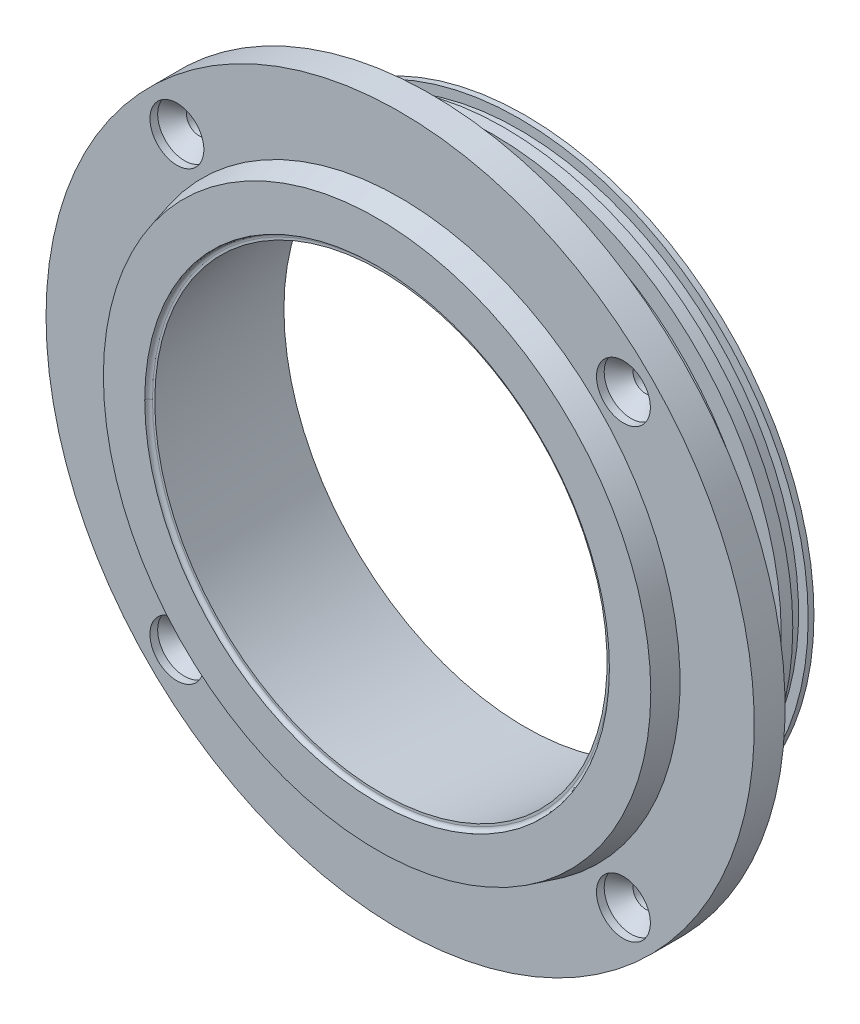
ISO-10303-21;
HEADER;
FILE_DESCRIPTION(('STEP AP214'),'2;1');
FILE_NAME('part.step','',(''),(''),'','','');
FILE_SCHEMA(('AUTOMOTIVE_DESIGN { 1 0 10303 214 1 1 1 1 }'));
ENDSEC;
DATA;
#1=APPLICATION_CONTEXT('core data for automotive mechanical design processes');
#2=APPLICATION_PROTOCOL_DEFINITION('international standard','automotive_design',2000,#1);
#3=PRODUCT_CONTEXT('',#1,'mechanical');
#4=PRODUCT('Part','Part','',(#3));
#5=PRODUCT_RELATED_PRODUCT_CATEGORY('part','',(#4));
#6=PRODUCT_DEFINITION_FORMATION('','',#4);
#7=PRODUCT_DEFINITION_CONTEXT('part definition',#1,'design');
#8=PRODUCT_DEFINITION('design','',#6,#7);
#9=PRODUCT_DEFINITION_SHAPE('','',#8);
#10=(LENGTH_UNIT() NAMED_UNIT(*) SI_UNIT(.MILLI.,.METRE.));
#11=(NAMED_UNIT(*) PLANE_ANGLE_UNIT() SI_UNIT($,.RADIAN.));
#12=(NAMED_UNIT(*) SI_UNIT($,.STERADIAN.) SOLID_ANGLE_UNIT());
#13=UNCERTAINTY_MEASURE_WITH_UNIT(LENGTH_MEASURE(1.E-05),#10,'distance_accuracy_value','');
#14=(GEOMETRIC_REPRESENTATION_CONTEXT(3) GLOBAL_UNCERTAINTY_ASSIGNED_CONTEXT((#13)) GLOBAL_UNIT_ASSIGNED_CONTEXT((#10,
#11,#12)) REPRESENTATION_CONTEXT('',''));
#15=CARTESIAN_POINT('',(0.,0.,0.));
#16=DIRECTION('',(0.,0.,1.));
#17=DIRECTION('',(1.,0.,0.));
#18=AXIS2_PLACEMENT_3D('',#15,#16,#17);
#19=CARTESIAN_POINT('',(0.,0.,-19.25));
#20=DIRECTION('',(0.,0.,-1.));
#21=DIRECTION('',(-1.,0.,0.));
#22=AXIS2_PLACEMENT_3D('',#19,#20,#21);
#23=CYLINDRICAL_SURFACE('',#22,75.);
#24=CARTESIAN_POINT('',(0.,0.,-30.));
#25=DIRECTION('',(0.,0.,-1.));
#26=DIRECTION('',(-1.,0.,0.));
#27=AXIS2_PLACEMENT_3D('',#24,#25,#26);
#28=CIRCLE('',#27,75.);
#29=CARTESIAN_POINT('',(-75.,0.,-30.));
#30=VERTEX_POINT('',#29);
#31=EDGE_CURVE('E20',#30,#30,#28,.T.);
#32=ORIENTED_EDGE('',*,*,#31,.T.);
#33=EDGE_LOOP('',(#32));
#34=FACE_BOUND('',#33,.T.);
#35=CARTESIAN_POINT('',(0.,0.,-33.));
#36=DIRECTION('',(0.,0.,-1.));
#37=DIRECTION('',(-1.,0.,0.));
#38=AXIS2_PLACEMENT_3D('',#35,#36,#37);
#39=CIRCLE('',#38,75.);
#40=CARTESIAN_POINT('',(-75.,0.,-33.));
#41=VERTEX_POINT('',#40);
#42=EDGE_CURVE('E233',#41,#41,#39,.T.);
#43=ORIENTED_EDGE('',*,*,#42,.F.);
#44=EDGE_LOOP('',(#43));
#45=FACE_BOUND('',#44,.T.);
#46=ADVANCED_FACE('F16',(#34,#45),#23,.T.);
#47=CARTESIAN_POINT('',(0.,102.385911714,-30.));
#48=DIRECTION('',(0.,0.,-1.));
#49=DIRECTION('',(-1.,0.,0.));
#50=AXIS2_PLACEMENT_3D('',#47,#48,#49);
#51=PLANE('',#50);
#52=CARTESIAN_POINT('',(0.,0.,-30.));
#53=DIRECTION('',(0.,0.,-1.));
#54=DIRECTION('',(-1.,0.,0.));
#55=AXIS2_PLACEMENT_3D('',#52,#53,#54);
#56=CIRCLE('',#55,70.);
#57=CARTESIAN_POINT('',(-70.,0.,-30.));
#58=VERTEX_POINT('',#57);
#59=EDGE_CURVE('E231',#58,#58,#56,.F.);
#60=ORIENTED_EDGE('',*,*,#59,.F.);
#61=EDGE_LOOP('',(#60));
#62=FACE_BOUND('',#61,.T.);
#63=ORIENTED_EDGE('',*,*,#31,.F.);
#64=EDGE_LOOP('',(#63));
#65=FACE_BOUND('',#64,.T.);
#66=ADVANCED_FACE('F242',(#62,#65),#51,.F.);
#67=CARTESIAN_POINT('',(0.,72.5,-33.));
#68=DIRECTION('',(0.,0.,-1.));
#69=DIRECTION('',(-1.,0.,0.));
#70=AXIS2_PLACEMENT_3D('',#67,#68,#69);
#71=PLANE('',#70);
#72=CARTESIAN_POINT('',(0.,0.,-33.));
#73=DIRECTION('',(0.,0.,-1.));
#74=DIRECTION('',(-1.,0.,0.));
#75=AXIS2_PLACEMENT_3D('',#72,#73,#74);
#76=CIRCLE('',#75,72.5);
#77=CARTESIAN_POINT('',(-72.5,0.,-33.));
#78=VERTEX_POINT('',#77);
#79=EDGE_CURVE('E228',#78,#78,#76,.T.);
#80=ORIENTED_EDGE('',*,*,#79,.F.);
#81=EDGE_LOOP('',(#80));
#82=FACE_BOUND('',#81,.T.);
#83=ORIENTED_EDGE('',*,*,#42,.T.);
#84=EDGE_LOOP('',(#83));
#85=FACE_BOUND('',#84,.T.);
#86=ADVANCED_FACE('F244',(#82,#85),#71,.T.);
#87=CARTESIAN_POINT('',(0.,0.,-26.4999995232));
#88=DIRECTION('',(0.,0.,-1.));
#89=DIRECTION('',(-1.,0.,0.));
#90=AXIS2_PLACEMENT_3D('',#87,#88,#89);
#91=CYLINDRICAL_SURFACE('',#90,70.);
#92=ORIENTED_EDGE('',*,*,#59,.T.);
#93=EDGE_LOOP('',(#92));
#94=FACE_BOUND('',#93,.T.);
#95=CARTESIAN_POINT('',(0.,0.,-22.));
#96=DIRECTION('',(0.,0.,-1.));
#97=DIRECTION('',(-1.,0.,0.));
#98=AXIS2_PLACEMENT_3D('',#95,#96,#97);
#99=CIRCLE('',#98,70.);
#100=CARTESIAN_POINT('',(-70.,0.,-22.));
#101=VERTEX_POINT('',#100);
#102=EDGE_CURVE('E225',#101,#101,#99,.F.);
#103=ORIENTED_EDGE('',*,*,#102,.F.);
#104=EDGE_LOOP('',(#103));
#105=FACE_BOUND('',#104,.T.);
#106=ADVANCED_FACE('F252',(#94,#105),#91,.T.);
#107=CARTESIAN_POINT('',(0.,0.,-26.4999995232));
#108=DIRECTION('',(0.,0.,-1.));
#109=DIRECTION('',(-1.,0.,0.));
#110=AXIS2_PLACEMENT_3D('',#107,#108,#109);
#111=CYLINDRICAL_SURFACE('',#110,72.5);
#112=CARTESIAN_POINT('',(0.,0.,-37.));
#113=DIRECTION('',(0.,0.,-1.));
#114=DIRECTION('',(-1.,0.,0.));
#115=AXIS2_PLACEMENT_3D('',#112,#113,#114);
#116=CIRCLE('',#115,72.5);
#117=CARTESIAN_POINT('',(-72.5,0.,-37.));
#118=VERTEX_POINT('',#117);
#119=EDGE_CURVE('E222',#118,#118,#116,.F.);
#120=ORIENTED_EDGE('',*,*,#119,.T.);
#121=EDGE_LOOP('',(#120));
#122=FACE_BOUND('',#121,.T.);
#123=ORIENTED_EDGE('',*,*,#79,.T.);
#124=EDGE_LOOP('',(#123));
#125=FACE_BOUND('',#124,.T.);
#126=ADVANCED_FACE('F463',(#122,#125),#111,.T.);
#127=CARTESIAN_POINT('',(0.,75.,-22.));
#128=DIRECTION('',(0.,0.,-1.));
#129=DIRECTION('',(-1.,0.,0.));
#130=AXIS2_PLACEMENT_3D('',#127,#128,#129);
#131=PLANE('',#130);
#132=ORIENTED_EDGE('',*,*,#102,.T.);
#133=EDGE_LOOP('',(#132));
#134=FACE_BOUND('',#133,.T.);
#135=CARTESIAN_POINT('',(0.,0.,-22.));
#136=DIRECTION('',(0.,0.,-1.));
#137=DIRECTION('',(-1.,0.,0.));
#138=AXIS2_PLACEMENT_3D('',#135,#136,#137);
#139=CIRCLE('',#138,77.);
#140=CARTESIAN_POINT('',(-77.,0.,-22.));
#141=VERTEX_POINT('',#140);
#142=EDGE_CURVE('E219',#141,#141,#139,.F.);
#143=ORIENTED_EDGE('',*,*,#142,.F.);
#144=EDGE_LOOP('',(#143));
#145=FACE_BOUND('',#144,.T.);
#146=ADVANCED_FACE('F459',(#134,#145),#131,.T.);
#147=CARTESIAN_POINT('',(0.,95.0767299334,-37.));
#148=DIRECTION('',(0.,0.,-1.));
#149=DIRECTION('',(-1.,0.,0.));
#150=AXIS2_PLACEMENT_3D('',#147,#148,#149);
#151=PLANE('',#150);
#152=ORIENTED_EDGE('',*,*,#119,.F.);
#153=EDGE_LOOP('',(#152));
#154=FACE_BOUND('',#153,.T.);
#155=CARTESIAN_POINT('',(0.,0.,-37.));
#156=DIRECTION('',(0.,0.,-1.));
#157=DIRECTION('',(-1.,0.,0.));
#158=AXIS2_PLACEMENT_3D('',#155,#156,#157);
#159=CIRCLE('',#158,75.);
#160=CARTESIAN_POINT('',(-75.,0.,-37.));
#161=VERTEX_POINT('',#160);
#162=EDGE_CURVE('E216',#161,#161,#159,.T.);
#163=ORIENTED_EDGE('',*,*,#162,.F.);
#164=EDGE_LOOP('',(#163));
#165=FACE_BOUND('',#164,.T.);
#166=ADVANCED_FACE('F455',(#154,#165),#151,.F.);
#167=CARTESIAN_POINT('',(0.,0.,-19.25));
#168=DIRECTION('',(0.,0.,-1.));
#169=DIRECTION('',(-1.,0.,0.));
#170=AXIS2_PLACEMENT_3D('',#167,#168,#169);
#171=CYLINDRICAL_SURFACE('',#170,77.);
#172=ORIENTED_EDGE('',*,*,#142,.T.);
#173=EDGE_LOOP('',(#172));
#174=FACE_BOUND('',#173,.T.);
#175=CARTESIAN_POINT('',(0.,0.,-20.));
#176=DIRECTION('',(0.,0.,-1.));
#177=DIRECTION('',(-1.,0.,0.));
#178=AXIS2_PLACEMENT_3D('',#175,#176,#177);
#179=CIRCLE('',#178,77.);
#180=CARTESIAN_POINT('',(-77.,0.,-20.));
#181=VERTEX_POINT('',#180);
#182=EDGE_CURVE('E213',#181,#181,#179,.T.);
#183=ORIENTED_EDGE('',*,*,#182,.T.);
#184=EDGE_LOOP('',(#183));
#185=FACE_BOUND('',#184,.T.);
#186=ADVANCED_FACE('F451',(#174,#185),#171,.T.);
#187=CARTESIAN_POINT('',(0.,0.,-19.25));
#188=DIRECTION('',(0.,0.,-1.));
#189=DIRECTION('',(-1.,0.,0.));
#190=AXIS2_PLACEMENT_3D('',#187,#188,#189);
#191=CYLINDRICAL_SURFACE('',#190,75.);
#192=CARTESIAN_POINT('',(0.,0.,-38.5));
#193=DIRECTION('',(0.,0.,-1.));
#194=DIRECTION('',(-1.,0.,0.));
#195=AXIS2_PLACEMENT_3D('',#192,#193,#194);
#196=CIRCLE('',#195,75.);
#197=CARTESIAN_POINT('',(-75.,0.,-38.5));
#198=VERTEX_POINT('',#197);
#199=EDGE_CURVE('E210',#198,#198,#196,.T.);
#200=ORIENTED_EDGE('',*,*,#199,.F.);
#201=EDGE_LOOP('',(#200));
#202=FACE_BOUND('',#201,.T.);
#203=ORIENTED_EDGE('',*,*,#162,.T.);
#204=EDGE_LOOP('',(#203));
#205=FACE_BOUND('',#204,.T.);
#206=ADVANCED_FACE('F447',(#202,#205),#191,.T.);
#207=CARTESIAN_POINT('',(0.,74.5,-20.));
#208=DIRECTION('',(0.,0.,-1.));
#209=DIRECTION('',(-1.,0.,0.));
#210=AXIS2_PLACEMENT_3D('',#207,#208,#209);
#211=PLANE('',#210);
#212=CARTESIAN_POINT('',(0.,0.,-20.));
#213=DIRECTION('',(0.,0.,-1.));
#214=DIRECTION('',(-1.,0.,0.));
#215=AXIS2_PLACEMENT_3D('',#212,#213,#214);
#216=CIRCLE('',#215,74.5);
#217=CARTESIAN_POINT('',(-74.5,0.,-20.));
#218=VERTEX_POINT('',#217);
#219=EDGE_CURVE('E207',#218,#218,#216,.F.);
#220=ORIENTED_EDGE('',*,*,#219,.F.);
#221=EDGE_LOOP('',(#220));
#222=FACE_BOUND('',#221,.T.);
#223=ORIENTED_EDGE('',*,*,#182,.F.);
#224=EDGE_LOOP('',(#223));
#225=FACE_BOUND('',#224,.T.);
#226=ADVANCED_FACE('F441',(#222,#225),#211,.F.);
#227=CARTESIAN_POINT('',(0.,62.6947781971,-38.5));
#228=DIRECTION('',(0.,0.,-1.));
#229=DIRECTION('',(-1.,0.,0.));
#230=AXIS2_PLACEMENT_3D('',#227,#228,#229);
#231=PLANE('',#230);
#232=CARTESIAN_POINT('',(0.,0.,-38.4999999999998));
#233=DIRECTION('',(0.,0.,-1.));
#234=DIRECTION('',(-1.,0.,0.));
#235=AXIS2_PLACEMENT_3D('',#232,#233,#234);
#236=CIRCLE('',#235,62.6947781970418);
#237=CARTESIAN_POINT('',(-62.6947781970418,0.,-38.4999999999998));
#238=VERTEX_POINT('',#237);
#239=EDGE_CURVE('E204',#238,#238,#236,.F.);
#240=ORIENTED_EDGE('',*,*,#239,.T.);
#241=EDGE_LOOP('',(#240));
#242=FACE_BOUND('',#241,.T.);
#243=ORIENTED_EDGE('',*,*,#199,.T.);
#244=EDGE_LOOP('',(#243));
#245=FACE_BOUND('',#244,.T.);
#246=ADVANCED_FACE('F435',(#242,#245),#231,.T.);
#247=CARTESIAN_POINT('',(0.,0.,-26.4999995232));
#248=DIRECTION('',(0.,0.,-1.));
#249=DIRECTION('',(-1.,0.,0.));
#250=AXIS2_PLACEMENT_3D('',#247,#248,#249);
#251=CYLINDRICAL_SURFACE('',#250,74.5);
#252=ORIENTED_EDGE('',*,*,#219,.T.);
#253=EDGE_LOOP('',(#252));
#254=FACE_BOUND('',#253,.T.);
#255=CARTESIAN_POINT('',(0.,0.,-16.));
#256=DIRECTION('',(0.,0.,-1.));
#257=DIRECTION('',(-1.,0.,0.));
#258=AXIS2_PLACEMENT_3D('',#255,#256,#257);
#259=CIRCLE('',#258,74.5);
#260=CARTESIAN_POINT('',(-74.5,0.,-16.));
#261=VERTEX_POINT('',#260);
#262=EDGE_CURVE('E201',#261,#261,#259,.F.);
#263=ORIENTED_EDGE('',*,*,#262,.F.);
#264=EDGE_LOOP('',(#263));
#265=FACE_BOUND('',#264,.T.);
#266=ADVANCED_FACE('F430',(#254,#265),#251,.T.);
#267=CARTESIAN_POINT('',(0.,0.,-38.4999999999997));
#268=DIRECTION('',(0.,0.,-1.));
#269=DIRECTION('',(-1.,0.,0.));
#270=AXIS2_PLACEMENT_3D('',#267,#268,#269);
#271=CONICAL_SURFACE('',#270,62.6947781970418,0.10471975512);
#272=ORIENTED_EDGE('',*,*,#239,.F.);
#273=EDGE_LOOP('',(#272));
#274=FACE_BOUND('',#273,.T.);
#275=CARTESIAN_POINT('',(0.,0.,-0.999999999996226));
#276=DIRECTION('',(0.,0.,-1.));
#277=DIRECTION('',(-1.,0.,0.));
#278=AXIS2_PLACEMENT_3D('',#275,#276,#277);
#279=CIRCLE('',#278,58.7533693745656);
#280=CARTESIAN_POINT('',(-58.7533693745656,0.,-0.999999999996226));
#281=VERTEX_POINT('',#280);
#282=EDGE_CURVE('E198',#281,#281,#279,.T.);
#283=ORIENTED_EDGE('',*,*,#282,.F.);
#284=EDGE_LOOP('',(#283));
#285=FACE_BOUND('',#284,.T.);
#286=ADVANCED_FACE('F425',(#274,#285),#271,.F.);
#287=CARTESIAN_POINT('',(0.,95.4478363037,-16.));
#288=DIRECTION('',(0.,0.,-1.));
#289=DIRECTION('',(-1.,0.,0.));
#290=AXIS2_PLACEMENT_3D('',#287,#288,#289);
#291=PLANE('',#290);
#292=ORIENTED_EDGE('',*,*,#262,.T.);
#293=EDGE_LOOP('',(#292));
#294=FACE_BOUND('',#293,.T.);
#295=CARTESIAN_POINT('',(0.,0.,-16.));
#296=DIRECTION('',(0.,0.,-1.));
#297=DIRECTION('',(-1.,0.,0.));
#298=AXIS2_PLACEMENT_3D('',#295,#296,#297);
#299=CIRCLE('',#298,77.);
#300=CARTESIAN_POINT('',(-77.,0.,-16.));
#301=VERTEX_POINT('',#300);
#302=EDGE_CURVE('E63',#301,#301,#299,.F.);
#303=ORIENTED_EDGE('',*,*,#302,.F.);
#304=EDGE_LOOP('',(#303));
#305=FACE_BOUND('',#304,.T.);
#306=ADVANCED_FACE('F87',(#294,#305),#291,.T.);
#307=CARTESIAN_POINT('',(65.2894,65.2894628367,-0.999999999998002));
#308=DIRECTION('',(0.,0.,1.));
#309=DIRECTION('',(0.,-1.,0.));
#310=AXIS2_PLACEMENT_3D('',#307,#308,#309);
#311=PLANE('',#310);
#312=ORIENTED_EDGE('',*,*,#282,.T.);
#313=EDGE_LOOP('',(#312));
#314=FACE_BOUND('',#313,.T.);
#315=CARTESIAN_POINT('',(-6.59003118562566E-11,59.3540571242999,-0.999999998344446));
#316=CARTESIAN_POINT('',(0.971179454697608,59.3540771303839,-0.999999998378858));
#317=CARTESIAN_POINT('',(1.94235714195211,59.3302203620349,-0.999999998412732));
#318=CARTESIAN_POINT('',(3.88237374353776,59.2349011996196,-0.999999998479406));
#319=CARTESIAN_POINT('',(4.85121265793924,59.1634388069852,-0.999999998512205));
#320=CARTESIAN_POINT('',(6.78421650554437,58.9730563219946,-0.99999999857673));
#321=CARTESIAN_POINT('',(7.74838143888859,58.8541362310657,-0.999999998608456));
#322=CARTESIAN_POINT('',(9.66971488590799,58.5691313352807,-0.999999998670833));
#323=CARTESIAN_POINT('',(10.6268833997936,58.4030465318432,-0.999999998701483));
#324=CARTESIAN_POINT('',(12.5319180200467,58.0241105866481,-0.99999999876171));
#325=CARTESIAN_POINT('',(13.479784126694,57.8112594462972,-0.999999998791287));
#326=CARTESIAN_POINT('',(15.3639304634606,57.3393040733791,-0.999999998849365));
#327=CARTESIAN_POINT('',(16.3002106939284,57.0801998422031,-0.999999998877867));
#328=CARTESIAN_POINT('',(18.1589296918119,56.5163623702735,-0.999999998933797));
#329=CARTESIAN_POINT('',(19.081368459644,56.2116291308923,-0.999999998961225));
#330=CARTESIAN_POINT('',(20.9101822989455,55.5572678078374,-0.999999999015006));
#331=CARTESIAN_POINT('',(21.816557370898,55.2076397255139,-0.999999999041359));
#332=CARTESIAN_POINT('',(23.6110602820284,54.4643309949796,-0.999999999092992));
#333=CARTESIAN_POINT('',(24.4991881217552,54.0706503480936,-0.999999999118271));
#334=CARTESIAN_POINT('',(26.2550569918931,53.2401849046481,-0.999999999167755));
#335=CARTESIAN_POINT('',(27.1227980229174,52.803400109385,-0.999999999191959));
#336=CARTESIAN_POINT('',(28.8358028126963,51.8877786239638,-0.999999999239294));
#337=CARTESIAN_POINT('',(29.6810665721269,51.4089419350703,-0.999999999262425));
#338=CARTESIAN_POINT('',(31.347080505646,50.4103702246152,-0.999999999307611));
#339=CARTESIAN_POINT('',(32.1678306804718,49.8906352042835,-0.999999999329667));
#340=CARTESIAN_POINT('',(33.7828401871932,48.8115189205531,-0.999999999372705));
#341=CARTESIAN_POINT('',(34.5770995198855,48.2521376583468,-0.999999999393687));
#342=CARTESIAN_POINT('',(36.1372139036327,47.0950764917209,-0.999999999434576));
#343=CARTESIAN_POINT('',(36.9030689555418,46.4973965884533,-0.999999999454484));
#344=CARTESIAN_POINT('',(38.40452976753,45.2651780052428,-0.999999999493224));
#345=CARTESIAN_POINT('',(39.1401355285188,44.6306393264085,-0.999999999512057));
#346=CARTESIAN_POINT('',(40.5793256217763,43.3262318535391,-0.999999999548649));
#347=CARTESIAN_POINT('',(41.2829099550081,42.6563630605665,-0.999999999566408));
#348=CARTESIAN_POINT('',(42.6563621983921,41.2829091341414,-0.999999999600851));
#349=CARTESIAN_POINT('',(43.3262301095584,40.5793240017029,-0.999999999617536));
#350=CARTESIAN_POINT('',(44.6306357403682,39.1401323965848,-0.99999999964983));
#351=CARTESIAN_POINT('',(45.2651734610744,38.4045259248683,-0.999999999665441));
#352=CARTESIAN_POINT('',(46.4973900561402,36.9030637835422,-0.999999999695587));
#353=CARTESIAN_POINT('',(47.0950689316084,36.1372081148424,-0.999999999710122));
#354=CARTESIAN_POINT('',(48.2521279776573,34.5770925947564,-0.999999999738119));
#355=CARTESIAN_POINT('',(48.8115081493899,33.7828327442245,-0.99999999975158));
#356=CARTESIAN_POINT('',(49.8906221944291,32.1678223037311,-0.999999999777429));
#357=CARTESIAN_POINT('',(50.4103560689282,31.3470717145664,-0.999999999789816));
#358=CARTESIAN_POINT('',(51.4089254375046,29.6810570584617,-0.999999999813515));
#359=CARTESIAN_POINT('',(51.887760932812,28.835792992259,-0.999999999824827));
#360=CARTESIAN_POINT('',(52.8033799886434,27.1227876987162,-0.999999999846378));
#361=CARTESIAN_POINT('',(53.2401635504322,26.2550464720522,-0.999999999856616));
#362=CARTESIAN_POINT('',(54.0706264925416,24.4991773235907,-0.999999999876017));
#363=CARTESIAN_POINT('',(54.4643058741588,23.6110494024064,-0.99999999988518));
#364=CARTESIAN_POINT('',(55.2076120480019,21.8165464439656,-0.999999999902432));
#365=CARTESIAN_POINT('',(55.5572388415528,20.9101714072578,-0.999999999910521));
#366=CARTESIAN_POINT('',(56.2115975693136,19.0813577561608,-0.999999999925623));
#367=CARTESIAN_POINT('',(56.5163295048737,18.1589191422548,-0.999999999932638));
#368=CARTESIAN_POINT('',(57.0801643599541,16.3002005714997,-0.999999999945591));
#369=CARTESIAN_POINT('',(57.3392672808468,15.3639206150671,-0.99999999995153));
#370=CARTESIAN_POINT('',(57.811220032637,13.4797749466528,-0.999999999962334));
#371=CARTESIAN_POINT('',(58.0240698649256,12.5319092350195,-0.999999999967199));
#372=CARTESIAN_POINT('',(58.4030032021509,10.6268755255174,-0.999999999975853));
#373=CARTESIAN_POINT('',(58.5690867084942,9.66970752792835,-0.999999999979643));
#374=CARTESIAN_POINT('',(58.854089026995,7.74837523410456,-0.999999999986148));
#375=CARTESIAN_POINT('',(58.9730078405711,6.78421093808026,-0.999999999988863));
#376=CARTESIAN_POINT('',(59.163387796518,4.85120848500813,-0.999999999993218));
#377=CARTESIAN_POINT('',(59.2348489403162,3.88237032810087,-0.999999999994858));
#378=CARTESIAN_POINT('',(59.3301656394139,1.9423553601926,-0.999999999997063));
#379=CARTESIAN_POINT('',(59.3540211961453,0.971178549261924,-0.999999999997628));
#380=CARTESIAN_POINT('',(59.3539999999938,-6.60465128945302E-11,-0.999999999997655));
#381=B_SPLINE_CURVE_WITH_KNOTS('',3,(#315,#316,#317,#318,#319,#320,#321,#322,#323,#324,#325,
#326,#327,#328,#329,#330,#331,#332,#333,#334,#335,#336,#337,#338,#339,#340,#341,#342,#343,#344,
#345,#346,#347,#348,#349,#350,#351,#352,#353,#354,#355,#356,#357,#358,#359,#360,#361,#362,#363,
#364,#365,#366,#367,#368,#369,#370,#371,#372,#373,#374,#375,#376,#377,#378,#379,#380),
.UNSPECIFIED.,.F.,.F.,(4,2,2,2,2,2,2,2,2,2,2,2,2,2,2,2,2,2,2,2,2,2,2,2,2,2,2,2,2,2,2,2,4),(0.,
2.91324291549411,5.82648574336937,8.73972848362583,11.6529711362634,14.5662137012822,
17.479456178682,20.3926985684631,23.3059408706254,26.2191830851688,29.1324252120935,
32.0456672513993,34.9589092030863,37.8721510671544,40.7853928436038,43.6986345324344,
46.6118761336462,49.5251176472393,52.4383590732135,55.3516004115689,58.2648416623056,
61.1780828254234,64.0913239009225,67.0045648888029,69.9178057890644,72.8310466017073,
75.7442873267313,78.6575279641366,81.5707685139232,84.484008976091,87.3972493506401,
90.3104896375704,93.223729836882),.UNSPECIFIED.);
#382=CARTESIAN_POINT('',(-6.59168900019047E-11,59.3540571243,-0.999999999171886));
#383=VERTEX_POINT('',#382);
#384=CARTESIAN_POINT('',(59.353999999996,-5.55325461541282E-11,-0.999999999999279));
#385=VERTEX_POINT('',#384);
#386=EDGE_CURVE('E184',#383,#385,#381,.T.);
#387=ORIENTED_EDGE('',*,*,#386,.F.);
#388=CARTESIAN_POINT('',(-59.3540000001,-6.60482476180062E-11,-0.99999999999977));
#389=CARTESIAN_POINT('',(-59.3540211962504,0.971178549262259,-0.999999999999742));
#390=CARTESIAN_POINT('',(-59.3301656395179,1.94235536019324,-0.999999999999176));
#391=CARTESIAN_POINT('',(-59.2348489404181,3.88237032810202,-0.999999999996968));
#392=CARTESIAN_POINT('',(-59.163387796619,4.85120848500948,-0.999999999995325));
#393=CARTESIAN_POINT('',(-58.9730078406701,6.78421093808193,-0.999999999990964));
#394=CARTESIAN_POINT('',(-58.854089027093,7.74837523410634,-0.999999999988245));
#395=CARTESIAN_POINT('',(-58.5690867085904,9.66970752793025,-0.99999999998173));
#396=CARTESIAN_POINT('',(-58.4030032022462,10.6268755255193,-0.999999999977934));
#397=CARTESIAN_POINT('',(-58.0240698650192,12.5319092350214,-0.999999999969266));
#398=CARTESIAN_POINT('',(-57.8112200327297,13.4797749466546,-0.999999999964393));
#399=CARTESIAN_POINT('',(-57.339267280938,15.3639206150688,-0.999999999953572));
#400=CARTESIAN_POINT('',(-57.0801643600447,16.3002005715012,-0.999999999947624));
#401=CARTESIAN_POINT('',(-56.5163295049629,18.1589191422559,-0.99999999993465));
#402=CARTESIAN_POINT('',(-56.2115975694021,19.0813577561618,-0.999999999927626));
#403=CARTESIAN_POINT('',(-55.5572388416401,20.9101714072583,-0.999999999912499));
#404=CARTESIAN_POINT('',(-55.2076120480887,21.8165464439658,-0.999999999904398));
#405=CARTESIAN_POINT('',(-54.4643058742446,23.6110494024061,-0.99999999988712));
#406=CARTESIAN_POINT('',(-54.070626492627,24.4991773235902,-0.999999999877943));
#407=CARTESIAN_POINT('',(-53.2401635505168,26.255046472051,-0.999999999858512));
#408=CARTESIAN_POINT('',(-52.8033799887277,27.1227876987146,-0.999999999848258));
#409=CARTESIAN_POINT('',(-51.8877609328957,28.8357929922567,-0.999999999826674));
#410=CARTESIAN_POINT('',(-51.408925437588,29.681057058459,-0.999999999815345));
#411=CARTESIAN_POINT('',(-50.4103560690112,31.347071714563,-0.99999999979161));
#412=CARTESIAN_POINT('',(-49.890622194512,32.1678223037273,-0.999999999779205));
#413=CARTESIAN_POINT('',(-48.8115081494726,33.7828327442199,-0.999999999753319));
#414=CARTESIAN_POINT('',(-48.25212797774,34.5770925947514,-0.999999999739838));
#415=CARTESIAN_POINT('',(-47.0950689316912,36.1372081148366,-0.9999999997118));
#416=CARTESIAN_POINT('',(-46.497390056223,36.9030637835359,-0.999999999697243));
#417=CARTESIAN_POINT('',(-45.2651734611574,38.4045259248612,-0.999999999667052));
#418=CARTESIAN_POINT('',(-44.6306357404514,39.1401323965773,-0.99999999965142));
#419=CARTESIAN_POINT('',(-43.326230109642,40.5793240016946,-0.999999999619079));
#420=CARTESIAN_POINT('',(-42.6563621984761,41.2829091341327,-0.99999999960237));
#421=CARTESIAN_POINT('',(-41.2829099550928,42.6563630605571,-0.999999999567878));
#422=CARTESIAN_POINT('',(-40.5793256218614,43.3262318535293,-0.999999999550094));
#423=CARTESIAN_POINT('',(-39.1401355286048,44.630639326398,-0.999999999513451));
#424=CARTESIAN_POINT('',(-38.4045297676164,45.2651780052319,-0.999999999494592));
#425=CARTESIAN_POINT('',(-36.9030689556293,46.4973965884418,-0.999999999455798));
#426=CARTESIAN_POINT('',(-36.1372139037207,47.0950764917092,-0.999999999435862));
#427=CARTESIAN_POINT('',(-34.5770995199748,48.2521376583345,-0.999999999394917));
#428=CARTESIAN_POINT('',(-33.7828401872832,48.8115189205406,-0.999999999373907));
#429=CARTESIAN_POINT('',(-32.1678306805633,49.8906352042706,-0.999999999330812));
#430=CARTESIAN_POINT('',(-31.3470805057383,50.4103702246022,-0.999999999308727));
#431=CARTESIAN_POINT('',(-29.6810665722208,51.4089419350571,-0.999999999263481));
#432=CARTESIAN_POINT('',(-28.8358028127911,51.8877786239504,-0.999999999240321));
#433=CARTESIAN_POINT('',(-27.122798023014,52.8034001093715,-0.999999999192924));
#434=CARTESIAN_POINT('',(-26.2550569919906,53.2401849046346,-0.999999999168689));
#435=CARTESIAN_POINT('',(-24.4991881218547,54.0706503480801,-0.999999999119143));
#436=CARTESIAN_POINT('',(-23.611060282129,54.4643309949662,-0.999999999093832));
#437=CARTESIAN_POINT('',(-21.8165573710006,55.2076397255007,-0.999999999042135));
#438=CARTESIAN_POINT('',(-20.9101822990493,55.5572678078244,-0.99999999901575));
#439=CARTESIAN_POINT('',(-19.0813684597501,56.2116291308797,-0.999999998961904));
#440=CARTESIAN_POINT('',(-18.1589296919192,56.5163623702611,-0.999999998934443));
#441=CARTESIAN_POINT('',(-16.300210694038,57.0801998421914,-0.999999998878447));
#442=CARTESIAN_POINT('',(-15.3639304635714,57.3393040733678,-0.999999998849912));
#443=CARTESIAN_POINT('',(-13.4797841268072,57.8112594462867,-0.999999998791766));
#444=CARTESIAN_POINT('',(-12.5319180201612,58.0241105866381,-0.999999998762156));
#445=CARTESIAN_POINT('',(-10.6268833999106,58.4030465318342,-0.999999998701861));
#446=CARTESIAN_POINT('',(-9.66971488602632,58.5691313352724,-0.999999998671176));
#447=CARTESIAN_POINT('',(-7.74838143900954,58.8541362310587,-0.999999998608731));
#448=CARTESIAN_POINT('',(-6.78421650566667,58.9730563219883,-0.999999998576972));
#449=CARTESIAN_POINT('',(-4.85121265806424,59.1634388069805,-0.999999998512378));
#450=CARTESIAN_POINT('',(-3.88237374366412,59.2349011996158,-0.999999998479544));
#451=CARTESIAN_POINT('',(-1.9423571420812,59.3302203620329,-0.999999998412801));
#452=CARTESIAN_POINT('',(-0.971179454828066,59.3540771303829,-0.999999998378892));
#453=CARTESIAN_POINT('',(-6.59003118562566E-11,59.3540571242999,-0.999999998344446));
#454=B_SPLINE_CURVE_WITH_KNOTS('',3,(#388,#389,#390,#391,#392,#393,#394,#395,#396,#397,#398,
#399,#400,#401,#402,#403,#404,#405,#406,#407,#408,#409,#410,#411,#412,#413,#414,#415,#416,#417,
#418,#419,#420,#421,#422,#423,#424,#425,#426,#427,#428,#429,#430,#431,#432,#433,#434,#435,#436,
#437,#438,#439,#440,#441,#442,#443,#444,#445,#446,#447,#448,#449,#450,#451,#452,#453),
.UNSPECIFIED.,.F.,.F.,(4,2,2,2,2,2,2,2,2,2,2,2,2,2,2,2,2,2,2,2,2,2,2,2,2,2,2,2,2,2,2,2,4),(0.,
2.91324019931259,5.82648048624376,8.7397208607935,11.6529613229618,14.5662018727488,
17.4794425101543,20.3926832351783,23.305924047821,26.2191649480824,29.1324059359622,
32.0456470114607,34.9588881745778,37.8721294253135,40.7853707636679,43.6986121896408,
46.6118537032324,49.5250953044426,52.4383369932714,55.351578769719,58.2648206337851,
61.1780625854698,64.0913046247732,67.0045467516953,69.917788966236,72.8310312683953,
75.7442736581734,78.6575161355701,81.5707587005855,84.4840013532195,87.3972440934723,
90.3104869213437,93.2237298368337),.UNSPECIFIED.);
#455=CARTESIAN_POINT('',(-59.3540000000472,-5.52697355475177E-11,-1.00000000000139));
#456=VERTEX_POINT('',#455);
#457=EDGE_CURVE('E69',#456,#383,#454,.T.);
#458=ORIENTED_EDGE('',*,*,#457,.F.);
#459=CARTESIAN_POINT('',(-2.09369659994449E-13,-3.66525634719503E-13,-1.00000000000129));
#460=DIRECTION('',(0.,0.,-1.));
#461=DIRECTION('',(-1.10781006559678E-12,-1.,0.));
#462=AXIS2_PLACEMENT_3D('',#459,#460,#461);
#463=CIRCLE('',#462,59.3539999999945);
#464=CARTESIAN_POINT('',(-6.59429108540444E-11,-59.3539999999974,-1.00000000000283));
#465=VERTEX_POINT('',#464);
#466=EDGE_CURVE('E55',#465,#456,#463,.T.);
#467=ORIENTED_EDGE('',*,*,#466,.F.);
#468=CARTESIAN_POINT('',(-2.09369659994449E-13,-3.66525634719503E-13,-1.00000000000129));
#469=DIRECTION('',(0.,0.,-1.));
#470=DIRECTION('',(1.,-1.10699171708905E-12,0.));
#471=AXIS2_PLACEMENT_3D('',#468,#469,#470);
#472=CIRCLE('',#471,59.3539999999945);
#473=EDGE_CURVE('E50',#385,#465,#472,.T.);
#474=ORIENTED_EDGE('',*,*,#473,.F.);
#475=EDGE_LOOP('',(#387,#458,#467,#474));
#476=FACE_BOUND('',#475,.T.);
#477=ADVANCED_FACE('F68',(#314,#476),#311,.T.);
#478=CARTESIAN_POINT('',(0.,0.,-19.25));
#479=DIRECTION('',(0.,0.,-1.));
#480=DIRECTION('',(-1.,0.,0.));
#481=AXIS2_PLACEMENT_3D('',#478,#479,#480);
#482=CYLINDRICAL_SURFACE('',#481,77.);
#483=CARTESIAN_POINT('',(0.,0.,-14.));
#484=DIRECTION('',(0.,0.,-1.));
#485=DIRECTION('',(-1.,0.,0.));
#486=AXIS2_PLACEMENT_3D('',#483,#484,#485);
#487=CIRCLE('',#486,77.);
#488=CARTESIAN_POINT('',(-77.,0.,-14.));
#489=VERTEX_POINT('',#488);
#490=EDGE_CURVE('E187',#489,#489,#487,.F.);
#491=ORIENTED_EDGE('',*,*,#490,.F.);
#492=EDGE_LOOP('',(#491));
#493=FACE_BOUND('',#492,.T.);
#494=ORIENTED_EDGE('',*,*,#302,.T.);
#495=EDGE_LOOP('',(#494));
#496=FACE_BOUND('',#495,.T.);
#497=ADVANCED_FACE('F86',(#493,#496),#482,.T.);
#498=CARTESIAN_POINT('',(58.,58.,-6.09999999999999));
#499=DIRECTION('',(0.,0.,-1.));
#500=DIRECTION('',(-1.,0.,0.));
#501=AXIS2_PLACEMENT_3D('',#498,#499,#500);
#502=CYLINDRICAL_SURFACE('',#501,3.25);
#503=CARTESIAN_POINT('',(58.,58.,-11.7500000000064));
#504=DIRECTION('',(0.,0.,1.));
#505=DIRECTION('',(0.877582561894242,-0.47942553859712,0.));
#506=AXIS2_PLACEMENT_3D('',#503,#504,#505);
#507=CIRCLE('',#506,3.25000000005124);
#508=CARTESIAN_POINT('',(60.8521433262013,56.4418669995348,-11.7500000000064));
#509=VERTEX_POINT('',#508);
#510=EDGE_CURVE('E309',#509,#509,#507,.T.);
#511=ORIENTED_EDGE('',*,*,#510,.T.);
#512=EDGE_LOOP('',(#511));
#513=FACE_BOUND('',#512,.T.);
#514=CARTESIAN_POINT('',(58.,58.,-14.));
#515=DIRECTION('',(0.,0.,-1.));
#516=DIRECTION('',(-1.,0.,0.));
#517=AXIS2_PLACEMENT_3D('',#514,#515,#516);
#518=CIRCLE('',#517,3.25);
#519=CARTESIAN_POINT('',(54.75,58.,-14.));
#520=VERTEX_POINT('',#519);
#521=EDGE_CURVE('E185',#520,#520,#518,.F.);
#522=ORIENTED_EDGE('',*,*,#521,.F.);
#523=EDGE_LOOP('',(#522));
#524=FACE_BOUND('',#523,.T.);
#525=ADVANCED_FACE('F130',(#513,#524),#502,.F.);
#526=CARTESIAN_POINT('',(58.7352119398,8.54822755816,-1.));
#527=CARTESIAN_POINT('',(59.1246642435,8.60490781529,-1.));
#528=CARTESIAN_POINT('',(59.519043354,8.66230511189,-0.790827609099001));
#529=CARTESIAN_POINT('',(59.7283835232,8.69277214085,-0.393548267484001));
#530=CARTESIAN_POINT('',(59.7307063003,8.69311019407,5.03763697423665E-12));
#531=(BOUNDED_CURVE() B_SPLINE_CURVE(4,(#526,#527,#528,#529,#530),.UNSPECIFIED.,.F.,
.F.) B_SPLINE_CURVE_WITH_KNOTS((5,5),(0.0827953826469,1.64762745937),
.UNSPECIFIED.) CURVE() GEOMETRIC_REPRESENTATION_ITEM() RATIONAL_B_SPLINE_CURVE((1.,1.,1.,1.,1.)) REPRESENTATION_ITEM(''));
#532=CARTESIAN_POINT('',(-2.28770491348E-13,-3.97346211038E-13,0.0891970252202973));
#533=DIRECTION('',(0.,0.,1.));
#534=AXIS1_PLACEMENT('',#532,#533);
#535=SURFACE_OF_REVOLUTION('',#531,#534);
#536=ORIENTED_EDGE('',*,*,#466,.T.);
#537=CARTESIAN_POINT('',(-60.3599821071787,-4.10320610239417E-13,1.69193252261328E-12));
#538=CARTESIAN_POINT('',(-60.3598842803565,-1.94573956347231E-13,-0.0164067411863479));
#539=CARTESIAN_POINT('',(-60.3593774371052,0.,-0.0328106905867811));
#540=CARTESIAN_POINT('',(-60.3575534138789,3.62794193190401E-13,-0.0655871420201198));
#541=CARTESIAN_POINT('',(-60.3562355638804,5.25828570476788E-13,-0.0819596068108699));
#542=CARTESIAN_POINT('',(-60.3527965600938,8.20631045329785E-13,-0.11462804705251));
#543=CARTESIAN_POINT('',(-60.350675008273,9.52383597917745E-13,-0.130923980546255));
#544=CARTESIAN_POINT('',(-60.3456370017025,1.18782613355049E-12,-0.163395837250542));
#545=CARTESIAN_POINT('',(-60.3427203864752,1.29151044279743E-12,-0.179571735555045));
#546=CARTESIAN_POINT('',(-60.3361019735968,1.47244710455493E-12,-0.211761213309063));
#547=CARTESIAN_POINT('',(-60.3324002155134,1.54970078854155E-12,-0.227774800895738));
#548=CARTESIAN_POINT('',(-60.3242225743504,1.67146072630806E-12,-0.259598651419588));
#549=CARTESIAN_POINT('',(-60.3197468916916,1.71597544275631E-12,-0.275408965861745));
#550=CARTESIAN_POINT('',(-60.310033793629,1.8305193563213E-12,-0.306786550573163));
#551=CARTESIAN_POINT('',(-60.3047966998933,1.90053779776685E-12,-0.322353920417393));
#552=CARTESIAN_POINT('',(-60.2935745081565,1.94698293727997E-12,-0.353207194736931));
#553=CARTESIAN_POINT('',(-60.2875898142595,1.92345998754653E-12,-0.368493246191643));
#554=CARTESIAN_POINT('',(-60.2748874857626,1.89891928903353E-12,-0.398746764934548));
#555=CARTESIAN_POINT('',(-60.2681703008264,1.89788781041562E-12,-0.41371442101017));
#556=CARTESIAN_POINT('',(-60.2540193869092,1.91314138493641E-12,-0.443295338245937));
#557=CARTESIAN_POINT('',(-60.2465861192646,1.92941535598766E-12,-0.457908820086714));
#558=CARTESIAN_POINT('',(-60.2310207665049,1.87717625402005E-12,-0.486746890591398));
#559=CARTESIAN_POINT('',(-60.2228891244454,1.80871657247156E-12,-0.500971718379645));
#560=CARTESIAN_POINT('',(-60.2059460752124,1.70886819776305E-12,-0.52899929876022));
#561=CARTESIAN_POINT('',(-60.1971350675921,1.67745788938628E-12,-0.542802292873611));
#562=CARTESIAN_POINT('',(-60.1788536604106,1.5961300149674E-12,-0.569954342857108));
#563=CARTESIAN_POINT('',(-60.1693835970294,1.54622182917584E-12,-0.583303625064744));
#564=CARTESIAN_POINT('',(-60.1498057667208,1.44166788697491E-12,-0.609517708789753));
#565=CARTESIAN_POINT('',(-60.1396982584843,1.38702404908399E-12,-0.622382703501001));
#566=CARTESIAN_POINT('',(-60.1188685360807,1.27691523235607E-12,-0.647598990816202));
#567=CARTESIAN_POINT('',(-60.1081464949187,1.22145048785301E-12,-0.659950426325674));
#568=CARTESIAN_POINT('',(-60.0861120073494,1.10457204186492E-12,-0.684111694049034));
#569=CARTESIAN_POINT('',(-60.0747996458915,1.04315919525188E-12,-0.69592160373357));
#570=CARTESIAN_POINT('',(-60.0516101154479,9.24036659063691E-13,-0.7189732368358));
#571=CARTESIAN_POINT('',(-60.0397329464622,8.66326969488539E-13,-0.730214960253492));
#572=CARTESIAN_POINT('',(-60.0154406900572,7.52354342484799E-13,-0.752104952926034));
#573=CARTESIAN_POINT('',(-60.0030255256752,6.96091613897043E-13,-0.76275313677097));
#574=CARTESIAN_POINT('',(-59.9776854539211,5.87853419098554E-13,-0.783432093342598));
#575=CARTESIAN_POINT('',(-59.9647604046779,5.35879158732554E-13,-0.793462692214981));
#576=CARTESIAN_POINT('',(-59.9384300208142,4.40983384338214E-13,-0.812883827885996));
#577=CARTESIAN_POINT('',(-59.9250244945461,3.98065530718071E-13,-0.822274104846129));
#578=CARTESIAN_POINT('',(-59.8977638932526,3.06300203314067E-13,-0.840393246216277));
#579=CARTESIAN_POINT('',(-59.8839085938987,2.57449736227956E-13,-0.849121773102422));
#580=CARTESIAN_POINT('',(-59.8557804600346,2.19425948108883E-13,-0.865897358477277));
#581=CARTESIAN_POINT('',(-59.8415073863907,2.30287497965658E-13,-0.873944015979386));
#582=CARTESIAN_POINT('',(-59.8125769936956,1.88971270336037E-13,-0.889337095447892));
#583=CARTESIAN_POINT('',(-59.7979194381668,1.36753762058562E-13,-0.896683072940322));
#584=CARTESIAN_POINT('',(-59.76825464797,0.,-0.910657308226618));
#585=CARTESIAN_POINT('',(-59.7532471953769,0.,-0.917285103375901));
#586=CARTESIAN_POINT('',(-59.7229184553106,1.26016685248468E-13,-0.929806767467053));
#587=CARTESIAN_POINT('',(-59.7075969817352,1.73513471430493E-13,-0.935700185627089));
#588=CARTESIAN_POINT('',(-59.6766773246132,2.14446521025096E-13,-0.94673816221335));
#589=CARTESIAN_POINT('',(-59.6610789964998,2.07853658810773E-13,-0.951882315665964));
#590=CARTESIAN_POINT('',(-59.6296440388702,2.60776744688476E-13,-0.961408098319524));
#591=CARTESIAN_POINT('',(-59.6138073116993,3.20320553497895E-13,-0.965789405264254));
#592=CARTESIAN_POINT('',(-59.5819352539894,4.4396120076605E-13,-0.973777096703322));
#593=CARTESIAN_POINT('',(-59.5658998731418,5.08059212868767E-13,-0.977383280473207));
#594=CARTESIAN_POINT('',(-59.5336714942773,6.62747696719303E-13,-0.983809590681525));
#595=CARTESIAN_POINT('',(-59.5174784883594,7.53339503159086E-13,-0.98662967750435));
#596=CARTESIAN_POINT('',(-59.4849771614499,9.59154964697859E-13,-0.991473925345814));
#597=CARTESIAN_POINT('',(-59.4686688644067,1.07437364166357E-12,-0.99349824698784));
#598=CARTESIAN_POINT('',(-59.4359804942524,1.32884190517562E-12,-0.996742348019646));
#599=CARTESIAN_POINT('',(-59.4196004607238,1.46807955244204E-12,-0.997962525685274));
#600=CARTESIAN_POINT('',(-59.38681371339,1.7714172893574E-12,-0.999591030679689));
#601=CARTESIAN_POINT('',(-59.3704070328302,1.9354967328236E-12,-1.00000002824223));
#602=CARTESIAN_POINT('',(-59.3539999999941,2.11250720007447E-12,-0.99999999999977));
#603=B_SPLINE_CURVE_WITH_KNOTS('',3,(#537,#538,#539,#540,#541,#542,#543,#544,#545,#546,#547,
#548,#549,#550,#551,#552,#553,#554,#555,#556,#557,#558,#559,#560,#561,#562,#563,#564,#565,#566,
#567,#568,#569,#570,#571,#572,#573,#574,#575,#576,#577,#578,#579,#580,#581,#582,#583,#584,#585,
#586,#587,#588,#589,#590,#591,#592,#593,#594,#595,#596,#597,#598,#599,#600,#601,#602),
.UNSPECIFIED.,.F.,.F.,(4,2,2,2,2,2,2,2,2,2,2,2,2,2,2,2,2,2,2,2,2,2,2,2,2,2,2,2,2,2,2,2,4),(0.,
0.0492155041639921,0.0984717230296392,0.147752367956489,0.197042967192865,0.246331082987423,
0.295606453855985,0.344861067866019,0.39408917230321,0.443287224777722,0.492453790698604,
0.541589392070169,0.590696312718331,0.63977836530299,0.688840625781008,0.737889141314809,
0.786930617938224,0.835972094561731,0.885020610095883,0.934082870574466,0.983164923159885,
1.03227184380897,1.08140744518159,1.13057401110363,1.17977206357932,1.22900016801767,
1.27825478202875,1.32753015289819,1.37681826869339,1.42610886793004,1.47538951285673,
1.52464573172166,1.57386123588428),.UNSPECIFIED.);
#604=CARTESIAN_POINT('',(-60.359982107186,-1.60675870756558E-11,1.45716771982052E-12));
#605=VERTEX_POINT('',#604);
#606=EDGE_CURVE('E71',#605,#456,#603,.T.);
#607=ORIENTED_EDGE('',*,*,#606,.F.);
#608=CARTESIAN_POINT('',(-2.27181709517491E-13,-3.9482223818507E-13,1.11022302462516E-12));
#609=DIRECTION('',(0.,0.,1.));
#610=DIRECTION('',(0.,-1.,0.));
#611=AXIS2_PLACEMENT_3D('',#608,#609,#610);
#612=CIRCLE('',#611,60.3599821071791);
#613=CARTESIAN_POINT('',(60.3599821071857,-2.92829996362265E-11,2.88657986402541E-12));
#614=VERTEX_POINT('',#613);
#615=EDGE_CURVE('E305',#605,#614,#612,.T.);
#616=ORIENTED_EDGE('',*,*,#615,.T.);
#617=CARTESIAN_POINT('',(59.3539999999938,-6.60465128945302E-11,-0.999999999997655));
#618=CARTESIAN_POINT('',(59.3704070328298,-6.58818585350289E-11,-1.00000002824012));
#619=CARTESIAN_POINT('',(59.3868137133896,-6.57343238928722E-11,-0.999591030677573));
#620=CARTESIAN_POINT('',(59.4196004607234,-6.54670127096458E-11,-0.997962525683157));
#621=CARTESIAN_POINT('',(59.4359804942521,-6.53472592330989E-11,-0.996742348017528));
#622=CARTESIAN_POINT('',(59.4686688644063,-6.51292263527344E-11,-0.99349824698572));
#623=CARTESIAN_POINT('',(59.4849771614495,-6.50309576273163E-11,-0.991473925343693));
#624=CARTESIAN_POINT('',(59.517478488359,-6.48630413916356E-11,-0.986629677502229));
#625=CARTESIAN_POINT('',(59.5336714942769,-6.47933996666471E-11,-0.983809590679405));
#626=CARTESIAN_POINT('',(59.5658998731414,-6.46708864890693E-11,-0.977383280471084));
#627=CARTESIAN_POINT('',(59.581935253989,-6.46180141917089E-11,-0.973777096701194));
#628=CARTESIAN_POINT('',(59.6138073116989,-6.45346413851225E-11,-0.965789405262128));
#629=CARTESIAN_POINT('',(59.6296440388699,-6.45041350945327E-11,-0.961408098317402));
#630=CARTESIAN_POINT('',(59.6610789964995,-6.44584432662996E-11,-0.951882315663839));
#631=CARTESIAN_POINT('',(59.6766773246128,-6.44432512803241E-11,-0.94673816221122));
#632=CARTESIAN_POINT('',(59.7075969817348,-6.44334569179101E-11,-0.935700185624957));
#633=CARTESIAN_POINT('',(59.7229184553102,-6.44388434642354E-11,-0.929806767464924));
#634=CARTESIAN_POINT('',(59.7532471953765,-6.44631409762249E-11,-0.917285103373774));
#635=CARTESIAN_POINT('',(59.7682546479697,-6.44820436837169E-11,-0.91065730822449));
#636=CARTESIAN_POINT('',(59.7979194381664,-6.45320792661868E-11,-0.896683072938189));
#637=CARTESIAN_POINT('',(59.8125769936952,-6.45632043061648E-11,-0.889337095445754));
#638=CARTESIAN_POINT('',(59.8415073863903,-6.46395074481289E-11,-0.873944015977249));
#639=CARTESIAN_POINT('',(59.8557804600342,-6.46846766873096E-11,-0.865897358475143));
#640=CARTESIAN_POINT('',(59.8839085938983,-6.47796055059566E-11,-0.849121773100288));
#641=CARTESIAN_POINT('',(59.8977638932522,-6.4829362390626E-11,-0.840393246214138));
#642=CARTESIAN_POINT('',(59.9250244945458,-6.49417117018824E-11,-0.822274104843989));
#643=CARTESIAN_POINT('',(59.9384300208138,-6.50042976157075E-11,-0.81288382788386));
#644=CARTESIAN_POINT('',(59.9647604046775,-6.51326645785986E-11,-0.793462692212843));
#645=CARTESIAN_POINT('',(59.9776854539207,-6.51984443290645E-11,-0.783432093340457));
#646=CARTESIAN_POINT('',(60.0030255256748,-6.53357437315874E-11,-0.762753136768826));
#647=CARTESIAN_POINT('',(60.0154406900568,-6.54072617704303E-11,-0.752104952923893));
#648=CARTESIAN_POINT('',(60.0397329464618,-6.55485455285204E-11,-0.730214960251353));
#649=CARTESIAN_POINT('',(60.0516101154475,-6.56183114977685E-11,-0.71897323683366));
#650=CARTESIAN_POINT('',(60.0747996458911,-6.57626862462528E-11,-0.695921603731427));
#651=CARTESIAN_POINT('',(60.0861120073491,-6.5837295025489E-11,-0.684111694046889));
#652=CARTESIAN_POINT('',(60.1081464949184,-6.59793979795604E-11,-0.659950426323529));
#653=CARTESIAN_POINT('',(60.1188685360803,-6.60468911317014E-11,-0.647598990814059));
#654=CARTESIAN_POINT('',(60.1396982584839,-6.61813013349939E-11,-0.622382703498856));
#655=CARTESIAN_POINT('',(60.1498057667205,-6.62482182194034E-11,-0.609517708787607));
#656=CARTESIAN_POINT('',(60.1693835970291,-6.63742115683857E-11,-0.583303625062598));
#657=CARTESIAN_POINT('',(60.1788536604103,-6.64332848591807E-11,-0.569954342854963));
#658=CARTESIAN_POINT('',(60.1971350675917,-6.65418265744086E-11,-0.542802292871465));
#659=CARTESIAN_POINT('',(60.205946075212,-6.65912901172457E-11,-0.52899929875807));
#660=CARTESIAN_POINT('',(60.222889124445,-6.66810654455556E-11,-0.500971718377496));
#661=CARTESIAN_POINT('',(60.2310207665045,-6.67213718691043E-11,-0.486746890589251));
#662=CARTESIAN_POINT('',(60.2465861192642,-6.67893152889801E-11,-0.457908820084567));
#663=CARTESIAN_POINT('',(60.2540193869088,-6.68169442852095E-11,-0.443295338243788));
#664=CARTESIAN_POINT('',(60.2681703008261,-6.68558084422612E-11,-0.41371442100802));
#665=CARTESIAN_POINT('',(60.2748874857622,-6.68670330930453E-11,-0.3987467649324));
#666=CARTESIAN_POINT('',(60.2875898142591,-6.68706984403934E-11,-0.368493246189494));
#667=CARTESIAN_POINT('',(60.293574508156,-6.68631276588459E-11,-0.353207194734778));
#668=CARTESIAN_POINT('',(60.3047966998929,-6.68320857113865E-11,-0.32235392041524));
#669=CARTESIAN_POINT('',(60.3100337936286,-6.68086059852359E-11,-0.306786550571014));
#670=CARTESIAN_POINT('',(60.3197468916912,-6.67365867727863E-11,-0.275408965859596));
#671=CARTESIAN_POINT('',(60.3242225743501,-6.66880367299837E-11,-0.259598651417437));
#672=CARTESIAN_POINT('',(60.332400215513,-6.6568405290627E-11,-0.227774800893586));
#673=CARTESIAN_POINT('',(60.3361019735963,-6.64973180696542E-11,-0.211761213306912));
#674=CARTESIAN_POINT('',(60.3427203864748,-6.63247023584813E-11,-0.179571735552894));
#675=CARTESIAN_POINT('',(60.3456370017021,-6.62231723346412E-11,-0.163395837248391));
#676=CARTESIAN_POINT('',(60.3506750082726,-6.59944674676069E-11,-0.130923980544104));
#677=CARTESIAN_POINT('',(60.3527965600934,-6.58672978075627E-11,-0.114628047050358));
#678=CARTESIAN_POINT('',(60.35623556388,-6.5579469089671E-11,-0.0819596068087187));
#679=CARTESIAN_POINT('',(60.3575534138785,-6.54188266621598E-11,-0.0655871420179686));
#680=CARTESIAN_POINT('',(60.3593774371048,-6.50628188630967E-11,-0.03281069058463));
#681=CARTESIAN_POINT('',(60.3598842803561,-6.4867482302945E-11,-0.0164067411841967));
#682=CARTESIAN_POINT('',(60.3599821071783,-6.46540698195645E-11,3.84294946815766E-12));
#683=B_SPLINE_CURVE_WITH_KNOTS('',3,(#617,#618,#619,#620,#621,#622,#623,#624,#625,#626,#627,
#628,#629,#630,#631,#632,#633,#634,#635,#636,#637,#638,#639,#640,#641,#642,#643,#644,#645,#646,
#647,#648,#649,#650,#651,#652,#653,#654,#655,#656,#657,#658,#659,#660,#661,#662,#663,#664,#665,
#666,#667,#668,#669,#670,#671,#672,#673,#674,#675,#676,#677,#678,#679,#680,#681,#682),
.UNSPECIFIED.,.F.,.F.,(4,2,2,2,2,2,2,2,2,2,2,2,2,2,2,2,2,2,2,2,2,2,2,2,2,2,2,2,2,2,2,2,4),(0.,
0.049215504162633,0.0984717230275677,0.147752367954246,0.197042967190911,0.246331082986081,
0.295606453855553,0.344861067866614,0.394089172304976,0.443287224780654,0.492453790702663,
0.541589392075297,0.590696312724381,0.639778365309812,0.688840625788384,0.737889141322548,
0.786930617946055,0.835972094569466,0.885020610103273,0.934082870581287,0.983164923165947,
1.0322718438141,1.08140744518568,1.13057401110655,1.17977206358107,1.22900016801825,
1.27825478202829,1.32753015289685,1.37681826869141,1.42610886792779,1.47538951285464,
1.52464573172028,1.57386123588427),.UNSPECIFIED.);
#684=EDGE_CURVE('E35',#385,#614,#683,.T.);
#685=ORIENTED_EDGE('',*,*,#684,.F.);
#686=ORIENTED_EDGE('',*,*,#473,.T.);
#687=EDGE_LOOP('',(#536,#607,#616,#685,#686));
#688=FACE_BOUND('',#687,.T.);
#689=ADVANCED_FACE('F53',(#688),#535,.F.);
#690=CARTESIAN_POINT('',(-58.7352119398,-8.54822755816,-1.));
#691=CARTESIAN_POINT('',(-59.1246642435,-8.60490781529,-1.));
#692=CARTESIAN_POINT('',(-59.519043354,-8.66230511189,-0.790827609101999));
#693=CARTESIAN_POINT('',(-59.7283835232,-8.69277214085,-0.393548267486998));
#694=CARTESIAN_POINT('',(-59.7307063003,-8.69311019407,1.45716771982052E-12));
#695=(BOUNDED_CURVE() B_SPLINE_CURVE(4,(#690,#691,#692,#693,#694),.UNSPECIFIED.,.F.,
.F.) B_SPLINE_CURVE_WITH_KNOTS((5,5),(0.0827953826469,1.64762745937),
.UNSPECIFIED.) CURVE() GEOMETRIC_REPRESENTATION_ITEM() RATIONAL_B_SPLINE_CURVE((1.,1.,1.,1.,1.)) REPRESENTATION_ITEM(''));
#696=CARTESIAN_POINT('',(-2.06656180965E-13,-3.71211116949E-13,0.0891970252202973));
#697=DIRECTION('',(0.,0.,1.));
#698=AXIS1_PLACEMENT('',#696,#697);
#699=SURFACE_OF_REVOLUTION('',#695,#698);
#700=ORIENTED_EDGE('',*,*,#386,.T.);
#701=ORIENTED_EDGE('',*,*,#684,.T.);
#702=CARTESIAN_POINT('',(-2.05067113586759E-13,-3.68687246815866E-13,-1.04083408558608E-12));
#703=DIRECTION('',(0.,0.,1.));
#704=DIRECTION('',(0.,-1.,0.));
#705=AXIS2_PLACEMENT_3D('',#702,#703,#704);
#706=CIRCLE('',#705,60.3599821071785);
#707=EDGE_CURVE('E302',#614,#605,#706,.T.);
#708=ORIENTED_EDGE('',*,*,#707,.T.);
#709=ORIENTED_EDGE('',*,*,#606,.T.);
#710=ORIENTED_EDGE('',*,*,#457,.T.);
#711=EDGE_LOOP('',(#700,#701,#708,#709,#710));
#712=FACE_BOUND('',#711,.T.);
#713=ADVANCED_FACE('F129',(#712),#699,.F.);
#714=CARTESIAN_POINT('',(-58.,58.,-6.09999999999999));
#715=DIRECTION('',(0.,0.,-1.));
#716=DIRECTION('',(-1.,0.,0.));
#717=AXIS2_PLACEMENT_3D('',#714,#715,#716);
#718=CYLINDRICAL_SURFACE('',#717,3.25);
#719=CARTESIAN_POINT('',(-58.,58.,-11.7500000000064));
#720=DIRECTION('',(0.,0.,1.));
#721=DIRECTION('',(0.47942553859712,0.877582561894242,0.));
#722=AXIS2_PLACEMENT_3D('',#719,#720,#721);
#723=CIRCLE('',#722,3.25000000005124);
#724=CARTESIAN_POINT('',(-56.4418669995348,60.8521433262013,-11.7500000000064));
#725=VERTEX_POINT('',#724);
#726=EDGE_CURVE('E304',#725,#725,#723,.T.);
#727=ORIENTED_EDGE('',*,*,#726,.T.);
#728=EDGE_LOOP('',(#727));
#729=FACE_BOUND('',#728,.T.);
#730=CARTESIAN_POINT('',(-58.,58.,-14.));
#731=DIRECTION('',(0.,0.,-1.));
#732=DIRECTION('',(-1.,0.,0.));
#733=AXIS2_PLACEMENT_3D('',#730,#731,#732);
#734=CIRCLE('',#733,3.25);
#735=CARTESIAN_POINT('',(-61.25,58.,-14.));
#736=VERTEX_POINT('',#735);
#737=EDGE_CURVE('E192',#736,#736,#734,.F.);
#738=ORIENTED_EDGE('',*,*,#737,.F.);
#739=EDGE_LOOP('',(#738));
#740=FACE_BOUND('',#739,.T.);
#741=ADVANCED_FACE('F323',(#729,#740),#718,.F.);
#742=CARTESIAN_POINT('',(-58.,-58.,-6.09999999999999));
#743=DIRECTION('',(0.,0.,-1.));
#744=DIRECTION('',(-1.,0.,0.));
#745=AXIS2_PLACEMENT_3D('',#742,#743,#744);
#746=CYLINDRICAL_SURFACE('',#745,3.25);
#747=CARTESIAN_POINT('',(-58.,-58.,-11.7500000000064));
#748=DIRECTION('',(0.,0.,1.));
#749=DIRECTION('',(-0.877582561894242,0.47942553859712,0.));
#750=AXIS2_PLACEMENT_3D('',#747,#748,#749);
#751=CIRCLE('',#750,3.25000000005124);
#752=CARTESIAN_POINT('',(-60.8521433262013,-56.4418669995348,-11.7500000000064));
#753=VERTEX_POINT('',#752);
#754=EDGE_CURVE('E396',#753,#753,#751,.T.);
#755=ORIENTED_EDGE('',*,*,#754,.T.);
#756=EDGE_LOOP('',(#755));
#757=FACE_BOUND('',#756,.T.);
#758=CARTESIAN_POINT('',(-58.,-58.,-14.));
#759=DIRECTION('',(0.,0.,-1.));
#760=DIRECTION('',(-1.,0.,0.));
#761=AXIS2_PLACEMENT_3D('',#758,#759,#760);
#762=CIRCLE('',#761,3.25);
#763=CARTESIAN_POINT('',(-61.25,-58.,-14.));
#764=VERTEX_POINT('',#763);
#765=EDGE_CURVE('E315',#764,#764,#762,.F.);
#766=ORIENTED_EDGE('',*,*,#765,.F.);
#767=EDGE_LOOP('',(#766));
#768=FACE_BOUND('',#767,.T.);
#769=ADVANCED_FACE('F325',(#757,#768),#746,.F.);
#770=CARTESIAN_POINT('',(58.,-58.,-6.09999999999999));
#771=DIRECTION('',(0.,0.,-1.));
#772=DIRECTION('',(-1.,0.,0.));
#773=AXIS2_PLACEMENT_3D('',#770,#771,#772);
#774=CYLINDRICAL_SURFACE('',#773,3.25);
#775=CARTESIAN_POINT('',(58.,-58.,-11.7500000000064));
#776=DIRECTION('',(0.,0.,1.));
#777=DIRECTION('',(-0.47942553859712,-0.877582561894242,0.));
#778=AXIS2_PLACEMENT_3D('',#775,#776,#777);
#779=CIRCLE('',#778,3.25000000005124);
#780=CARTESIAN_POINT('',(56.4418669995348,-60.8521433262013,-11.7500000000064));
#781=VERTEX_POINT('',#780);
#782=EDGE_CURVE('E301',#781,#781,#779,.T.);
#783=ORIENTED_EDGE('',*,*,#782,.T.);
#784=EDGE_LOOP('',(#783));
#785=FACE_BOUND('',#784,.T.);
#786=CARTESIAN_POINT('',(58.,-58.,-14.));
#787=DIRECTION('',(0.,0.,-1.));
#788=DIRECTION('',(-1.,0.,0.));
#789=AXIS2_PLACEMENT_3D('',#786,#787,#788);
#790=CIRCLE('',#789,3.25);
#791=CARTESIAN_POINT('',(54.75,-58.,-14.));
#792=VERTEX_POINT('',#791);
#793=EDGE_CURVE('E312',#792,#792,#790,.F.);
#794=ORIENTED_EDGE('',*,*,#793,.F.);
#795=EDGE_LOOP('',(#794));
#796=FACE_BOUND('',#795,.T.);
#797=ADVANCED_FACE('F331',(#785,#796),#774,.F.);
#798=CARTESIAN_POINT('',(0.,77.,-14.));
#799=DIRECTION('',(0.,0.,-1.));
#800=DIRECTION('',(-1.,0.,0.));
#801=AXIS2_PLACEMENT_3D('',#798,#799,#800);
#802=PLANE('',#801);
#803=ORIENTED_EDGE('',*,*,#793,.T.);
#804=EDGE_LOOP('',(#803));
#805=FACE_BOUND('',#804,.T.);
#806=ORIENTED_EDGE('',*,*,#765,.T.);
#807=EDGE_LOOP('',(#806));
#808=FACE_BOUND('',#807,.T.);
#809=ORIENTED_EDGE('',*,*,#737,.T.);
#810=EDGE_LOOP('',(#809));
#811=FACE_BOUND('',#810,.T.);
#812=ORIENTED_EDGE('',*,*,#490,.T.);
#813=EDGE_LOOP('',(#812));
#814=FACE_BOUND('',#813,.T.);
#815=ORIENTED_EDGE('',*,*,#521,.T.);
#816=EDGE_LOOP('',(#815));
#817=FACE_BOUND('',#816,.T.);
#818=CARTESIAN_POINT('',(0.,0.,-14.));
#819=DIRECTION('',(0.,0.,-1.));
#820=DIRECTION('',(-1.,0.,0.));
#821=AXIS2_PLACEMENT_3D('',#818,#819,#820);
#822=CIRCLE('',#821,92.);
#823=CARTESIAN_POINT('',(-92.,0.,-14.));
#824=VERTEX_POINT('',#823);
#825=EDGE_CURVE('E298',#824,#824,#822,.F.);
#826=ORIENTED_EDGE('',*,*,#825,.F.);
#827=EDGE_LOOP('',(#826));
#828=FACE_BOUND('',#827,.T.);
#829=ADVANCED_FACE('F320',(#805,#808,#811,#814,#817,#828),#802,.T.);
#830=CARTESIAN_POINT('',(58.,58.,-8.00000000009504));
#831=DIRECTION('',(0.,0.,1.));
#832=DIRECTION('',(1.,0.,0.));
#833=AXIS2_PLACEMENT_3D('',#830,#831,#832);
#834=CONICAL_SURFACE('',#833,6.99999999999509,0.785398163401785);
#835=CARTESIAN_POINT('',(58.,58.,-7.99999999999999));
#836=DIRECTION('',(0.,0.,-1.));
#837=DIRECTION('',(-1.,0.,0.));
#838=AXIS2_PLACEMENT_3D('',#835,#836,#837);
#839=CIRCLE('',#838,7.);
#840=CARTESIAN_POINT('',(51.,58.,-7.99999999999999));
#841=VERTEX_POINT('',#840);
#842=EDGE_CURVE('E297',#841,#841,#839,.F.);
#843=ORIENTED_EDGE('',*,*,#842,.T.);
#844=EDGE_LOOP('',(#843));
#845=FACE_BOUND('',#844,.T.);
#846=ORIENTED_EDGE('',*,*,#510,.F.);
#847=EDGE_LOOP('',(#846));
#848=FACE_BOUND('',#847,.T.);
#849=ADVANCED_FACE('F341',(#845,#848),#834,.F.);
#850=CARTESIAN_POINT('',(0.,71.1051177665,0.));
#851=DIRECTION('',(0.,0.,-1.));
#852=DIRECTION('',(-1.,0.,0.));
#853=AXIS2_PLACEMENT_3D('',#850,#851,#852);
#854=PLANE('',#853);
#855=ORIENTED_EDGE('',*,*,#615,.F.);
#856=ORIENTED_EDGE('',*,*,#707,.F.);
#857=EDGE_LOOP('',(#855,#856));
#858=FACE_BOUND('',#857,.T.);
#859=CARTESIAN_POINT('',(0.,0.,-1.04360964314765E-11));
#860=DIRECTION('',(0.,0.,-1.));
#861=DIRECTION('',(-1.,0.,0.));
#862=AXIS2_PLACEMENT_3D('',#859,#860,#861);
#863=CIRCLE('',#862,71.1051177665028);
#864=CARTESIAN_POINT('',(-71.1051177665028,0.,-1.04364686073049E-11));
#865=VERTEX_POINT('',#864);
#866=EDGE_CURVE('E293',#865,#865,#863,.T.);
#867=ORIENTED_EDGE('',*,*,#866,.F.);
#868=EDGE_LOOP('',(#867));
#869=FACE_BOUND('',#868,.T.);
#870=ADVANCED_FACE('F345',(#858,#869),#854,.F.);
#871=CARTESIAN_POINT('',(-58.,58.,-7.99999999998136));
#872=DIRECTION('',(0.,0.,1.));
#873=DIRECTION('',(1.,0.,0.));
#874=AXIS2_PLACEMENT_3D('',#871,#872,#873);
#875=CONICAL_SURFACE('',#874,7.0000000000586,0.785398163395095);
#876=CARTESIAN_POINT('',(-58.,58.,-7.99999999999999));
#877=DIRECTION('',(0.,0.,-1.));
#878=DIRECTION('',(-1.,0.,0.));
#879=AXIS2_PLACEMENT_3D('',#876,#877,#878);
#880=CIRCLE('',#879,7.);
#881=CARTESIAN_POINT('',(-65.,58.,-7.99999999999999));
#882=VERTEX_POINT('',#881);
#883=EDGE_CURVE('E296',#882,#882,#880,.F.);
#884=ORIENTED_EDGE('',*,*,#883,.T.);
#885=EDGE_LOOP('',(#884));
#886=FACE_BOUND('',#885,.T.);
#887=ORIENTED_EDGE('',*,*,#726,.F.);
#888=EDGE_LOOP('',(#887));
#889=FACE_BOUND('',#888,.T.);
#890=ADVANCED_FACE('F349',(#886,#889),#875,.F.);
#891=CARTESIAN_POINT('',(-58.,-58.,-8.00000000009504));
#892=DIRECTION('',(0.,0.,1.));
#893=DIRECTION('',(1.,0.,0.));
#894=AXIS2_PLACEMENT_3D('',#891,#892,#893);
#895=CONICAL_SURFACE('',#894,6.99999999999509,0.785398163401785);
#896=CARTESIAN_POINT('',(-58.,-58.,-7.99999999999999));
#897=DIRECTION('',(0.,0.,-1.));
#898=DIRECTION('',(-1.,0.,0.));
#899=AXIS2_PLACEMENT_3D('',#896,#897,#898);
#900=CIRCLE('',#899,7.);
#901=CARTESIAN_POINT('',(-65.,-58.,-7.99999999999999));
#902=VERTEX_POINT('',#901);
#903=EDGE_CURVE('E290',#902,#902,#900,.F.);
#904=ORIENTED_EDGE('',*,*,#903,.T.);
#905=EDGE_LOOP('',(#904));
#906=FACE_BOUND('',#905,.T.);
#907=ORIENTED_EDGE('',*,*,#754,.F.);
#908=EDGE_LOOP('',(#907));
#909=FACE_BOUND('',#908,.T.);
#910=ADVANCED_FACE('F353',(#906,#909),#895,.F.);
#911=CARTESIAN_POINT('',(58.,-58.,-7.99999999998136));
#912=DIRECTION('',(0.,0.,1.));
#913=DIRECTION('',(1.,0.,0.));
#914=AXIS2_PLACEMENT_3D('',#911,#912,#913);
#915=CONICAL_SURFACE('',#914,7.0000000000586,0.785398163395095);
#916=CARTESIAN_POINT('',(58.,-58.,-7.99999999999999));
#917=DIRECTION('',(0.,0.,-1.));
#918=DIRECTION('',(-1.,0.,0.));
#919=AXIS2_PLACEMENT_3D('',#916,#917,#918);
#920=CIRCLE('',#919,7.);
#921=CARTESIAN_POINT('',(51.,-58.,-7.99999999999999));
#922=VERTEX_POINT('',#921);
#923=EDGE_CURVE('E286',#922,#922,#920,.F.);
#924=ORIENTED_EDGE('',*,*,#923,.T.);
#925=EDGE_LOOP('',(#924));
#926=FACE_BOUND('',#925,.T.);
#927=ORIENTED_EDGE('',*,*,#782,.F.);
#928=EDGE_LOOP('',(#927));
#929=FACE_BOUND('',#928,.T.);
#930=ADVANCED_FACE('F357',(#926,#929),#915,.F.);
#931=CARTESIAN_POINT('',(0.,0.,-19.25));
#932=DIRECTION('',(0.,0.,-1.));
#933=DIRECTION('',(-1.,0.,0.));
#934=AXIS2_PLACEMENT_3D('',#931,#932,#933);
#935=CYLINDRICAL_SURFACE('',#934,92.);
#936=CARTESIAN_POINT('',(0.,0.,-6.00000000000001));
#937=DIRECTION('',(0.,0.,-1.));
#938=DIRECTION('',(-1.,0.,0.));
#939=AXIS2_PLACEMENT_3D('',#936,#937,#938);
#940=CIRCLE('',#939,92.);
#941=CARTESIAN_POINT('',(-92.,0.,-6.00000000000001));
#942=VERTEX_POINT('',#941);
#943=EDGE_CURVE('E284',#942,#942,#940,.T.);
#944=ORIENTED_EDGE('',*,*,#943,.T.);
#945=EDGE_LOOP('',(#944));
#946=FACE_BOUND('',#945,.T.);
#947=ORIENTED_EDGE('',*,*,#825,.T.);
#948=EDGE_LOOP('',(#947));
#949=FACE_BOUND('',#948,.T.);
#950=ADVANCED_FACE('F361',(#946,#949),#935,.T.);
#951=CARTESIAN_POINT('',(58.,58.,-6.09999999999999));
#952=DIRECTION('',(0.,0.,-1.));
#953=DIRECTION('',(-1.,0.,0.));
#954=AXIS2_PLACEMENT_3D('',#951,#952,#953);
#955=CYLINDRICAL_SURFACE('',#954,7.);
#956=ORIENTED_EDGE('',*,*,#842,.F.);
#957=EDGE_LOOP('',(#956));
#958=FACE_BOUND('',#957,.T.);
#959=CARTESIAN_POINT('',(58.,58.,-6.00000000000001));
#960=DIRECTION('',(0.,0.,-1.));
#961=DIRECTION('',(-1.,0.,0.));
#962=AXIS2_PLACEMENT_3D('',#959,#960,#961);
#963=CIRCLE('',#962,7.);
#964=CARTESIAN_POINT('',(51.,58.,-6.00000000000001));
#965=VERTEX_POINT('',#964);
#966=EDGE_CURVE('E281',#965,#965,#963,.F.);
#967=ORIENTED_EDGE('',*,*,#966,.T.);
#968=EDGE_LOOP('',(#967));
#969=FACE_BOUND('',#968,.T.);
#970=ADVANCED_FACE('F365',(#958,#969),#955,.F.);
#971=CARTESIAN_POINT('',(0.,0.,-6.00000000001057));
#972=DIRECTION('',(0.,0.,-1.));
#973=DIRECTION('',(-1.,0.,0.));
#974=AXIS2_PLACEMENT_3D('',#971,#972,#973);
#975=CONICAL_SURFACE('',#974,72.7128129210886,0.261799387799);
#976=ORIENTED_EDGE('',*,*,#866,.T.);
#977=EDGE_LOOP('',(#976));
#978=FACE_BOUND('',#977,.T.);
#979=CARTESIAN_POINT('',(0.,0.,-6.00000000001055));
#980=DIRECTION('',(0.,0.,-1.));
#981=DIRECTION('',(-1.,0.,0.));
#982=AXIS2_PLACEMENT_3D('',#979,#980,#981);
#983=CIRCLE('',#982,72.7128129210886);
#984=CARTESIAN_POINT('',(-72.7128129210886,0.,-6.00000000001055));
#985=VERTEX_POINT('',#984);
#986=EDGE_CURVE('E277',#985,#985,#983,.F.);
#987=ORIENTED_EDGE('',*,*,#986,.T.);
#988=EDGE_LOOP('',(#987));
#989=FACE_BOUND('',#988,.T.);
#990=ADVANCED_FACE('F368',(#978,#989),#975,.T.);
#991=CARTESIAN_POINT('',(-58.,58.,-6.09999999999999));
#992=DIRECTION('',(0.,0.,-1.));
#993=DIRECTION('',(-1.,0.,0.));
#994=AXIS2_PLACEMENT_3D('',#991,#992,#993);
#995=CYLINDRICAL_SURFACE('',#994,7.);
#996=ORIENTED_EDGE('',*,*,#883,.F.);
#997=EDGE_LOOP('',(#996));
#998=FACE_BOUND('',#997,.T.);
#999=CARTESIAN_POINT('',(-58.,58.,-6.00000000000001));
#1000=DIRECTION('',(0.,0.,-1.));
#1001=DIRECTION('',(-1.,0.,0.));
#1002=AXIS2_PLACEMENT_3D('',#999,#1000,#1001);
#1003=CIRCLE('',#1002,7.);
#1004=CARTESIAN_POINT('',(-65.,58.,-6.00000000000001));
#1005=VERTEX_POINT('',#1004);
#1006=EDGE_CURVE('E273',#1005,#1005,#1003,.F.);
#1007=ORIENTED_EDGE('',*,*,#1006,.T.);
#1008=EDGE_LOOP('',(#1007));
#1009=FACE_BOUND('',#1008,.T.);
#1010=ADVANCED_FACE('F372',(#998,#1009),#995,.F.);
#1011=CARTESIAN_POINT('',(-58.,-58.,-6.09999999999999));
#1012=DIRECTION('',(0.,0.,-1.));
#1013=DIRECTION('',(-1.,0.,0.));
#1014=AXIS2_PLACEMENT_3D('',#1011,#1012,#1013);
#1015=CYLINDRICAL_SURFACE('',#1014,7.);
#1016=ORIENTED_EDGE('',*,*,#903,.F.);
#1017=EDGE_LOOP('',(#1016));
#1018=FACE_BOUND('',#1017,.T.);
#1019=CARTESIAN_POINT('',(-58.,-58.,-6.00000000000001));
#1020=DIRECTION('',(0.,0.,-1.));
#1021=DIRECTION('',(-1.,0.,0.));
#1022=AXIS2_PLACEMENT_3D('',#1019,#1020,#1021);
#1023=CIRCLE('',#1022,7.);
#1024=CARTESIAN_POINT('',(-65.,-58.,-6.00000000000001));
#1025=VERTEX_POINT('',#1024);
#1026=EDGE_CURVE('E26',#1025,#1025,#1023,.F.);
#1027=ORIENTED_EDGE('',*,*,#1026,.T.);
#1028=EDGE_LOOP('',(#1027));
#1029=FACE_BOUND('',#1028,.T.);
#1030=ADVANCED_FACE('F263',(#1018,#1029),#1015,.F.);
#1031=CARTESIAN_POINT('',(58.,-58.,-6.09999999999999));
#1032=DIRECTION('',(0.,0.,-1.));
#1033=DIRECTION('',(-1.,0.,0.));
#1034=AXIS2_PLACEMENT_3D('',#1031,#1032,#1033);
#1035=CYLINDRICAL_SURFACE('',#1034,7.);
#1036=ORIENTED_EDGE('',*,*,#923,.F.);
#1037=EDGE_LOOP('',(#1036));
#1038=FACE_BOUND('',#1037,.T.);
#1039=CARTESIAN_POINT('',(58.,-58.,-6.00000000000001));
#1040=DIRECTION('',(0.,0.,-1.));
#1041=DIRECTION('',(-1.,0.,0.));
#1042=AXIS2_PLACEMENT_3D('',#1039,#1040,#1041);
#1043=CIRCLE('',#1042,7.);
#1044=CARTESIAN_POINT('',(51.,-58.,-6.00000000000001));
#1045=VERTEX_POINT('',#1044);
#1046=EDGE_CURVE('E11',#1045,#1045,#1043,.F.);
#1047=ORIENTED_EDGE('',*,*,#1046,.T.);
#1048=EDGE_LOOP('',(#1047));
#1049=FACE_BOUND('',#1048,.T.);
#1050=ADVANCED_FACE('F258',(#1038,#1049),#1035,.F.);
#1051=CARTESIAN_POINT('',(0.,92.,-6.00000000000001));
#1052=DIRECTION('',(0.,0.,-1.));
#1053=DIRECTION('',(-1.,0.,0.));
#1054=AXIS2_PLACEMENT_3D('',#1051,#1052,#1053);
#1055=PLANE('',#1054);
#1056=ORIENTED_EDGE('',*,*,#1046,.F.);
#1057=EDGE_LOOP('',(#1056));
#1058=FACE_BOUND('',#1057,.T.);
#1059=ORIENTED_EDGE('',*,*,#1026,.F.);
#1060=EDGE_LOOP('',(#1059));
#1061=FACE_BOUND('',#1060,.T.);
#1062=ORIENTED_EDGE('',*,*,#1006,.F.);
#1063=EDGE_LOOP('',(#1062));
#1064=FACE_BOUND('',#1063,.T.);
#1065=ORIENTED_EDGE('',*,*,#986,.F.);
#1066=EDGE_LOOP('',(#1065));
#1067=FACE_BOUND('',#1066,.T.);
#1068=ORIENTED_EDGE('',*,*,#966,.F.);
#1069=EDGE_LOOP('',(#1068));
#1070=FACE_BOUND('',#1069,.T.);
#1071=ORIENTED_EDGE('',*,*,#943,.F.);
#1072=EDGE_LOOP('',(#1071));
#1073=FACE_BOUND('',#1072,.T.);
#1074=ADVANCED_FACE('F18',(#1058,#1061,#1064,#1067,#1070,#1073),#1055,.F.);
#1075=CLOSED_SHELL('',(#46,#66,#86,#106,#126,#146,#166,#186,#206,#226,#246,#266,#286,#306,#477,
#497,#525,#689,#713,#741,#769,#797,#829,#849,#870,#890,#910,#930,#950,#970,#990,#1010,#1030,
#1050,#1074));
#1076=MANIFOLD_SOLID_BREP('B1',#1075);
#1077=ADVANCED_BREP_SHAPE_REPRESENTATION('',(#18,#1076),#14);
#1078=SHAPE_DEFINITION_REPRESENTATION(#9,#1077);
ENDSEC;
END-ISO-10303-21;
